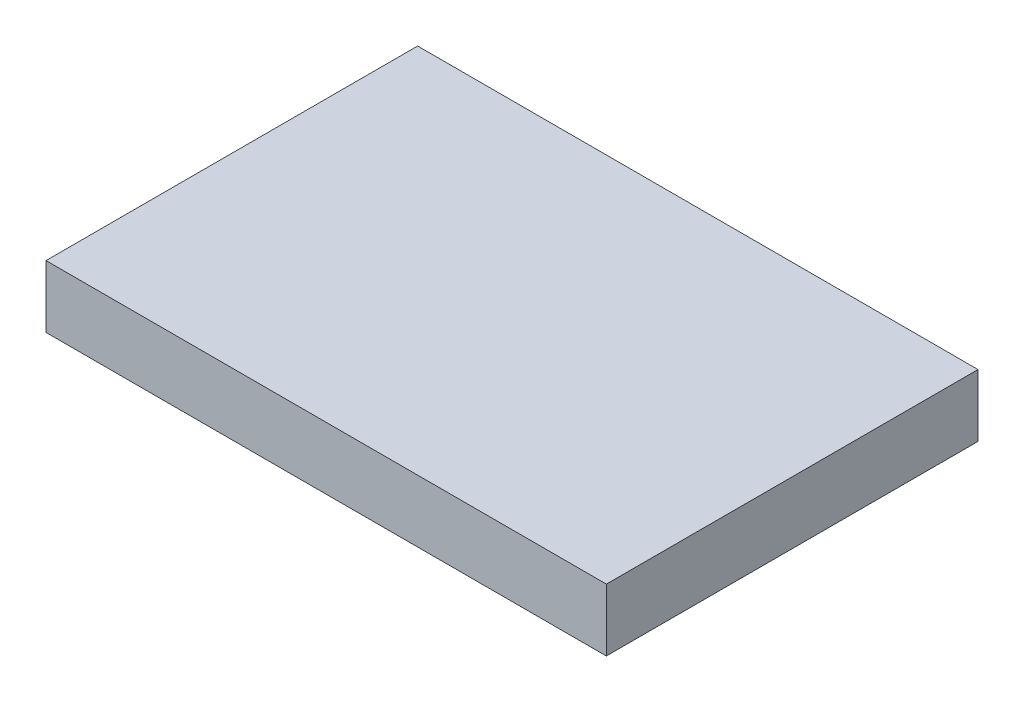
from build123d import *

# Parameters (mm, degrees)
SKETCH1_W           = 7315.2
SKETCH1_H           = 4851.4
BOSS_EXTRUDE1_DEPTH = 812.8


with BuildPart() as part:
    # Sketch1 → Boss-Extrude1 (new body)
    with BuildSketch(Plane(origin=(0, 0, 0), x_dir=(1, 0, 0), z_dir=(0, 1, 0))):
        with Locations((3657.6, 2425.7)):
            Rectangle(SKETCH1_W, SKETCH1_H)
    extrude(amount=BOSS_EXTRUDE1_DEPTH)


solid = part.part
